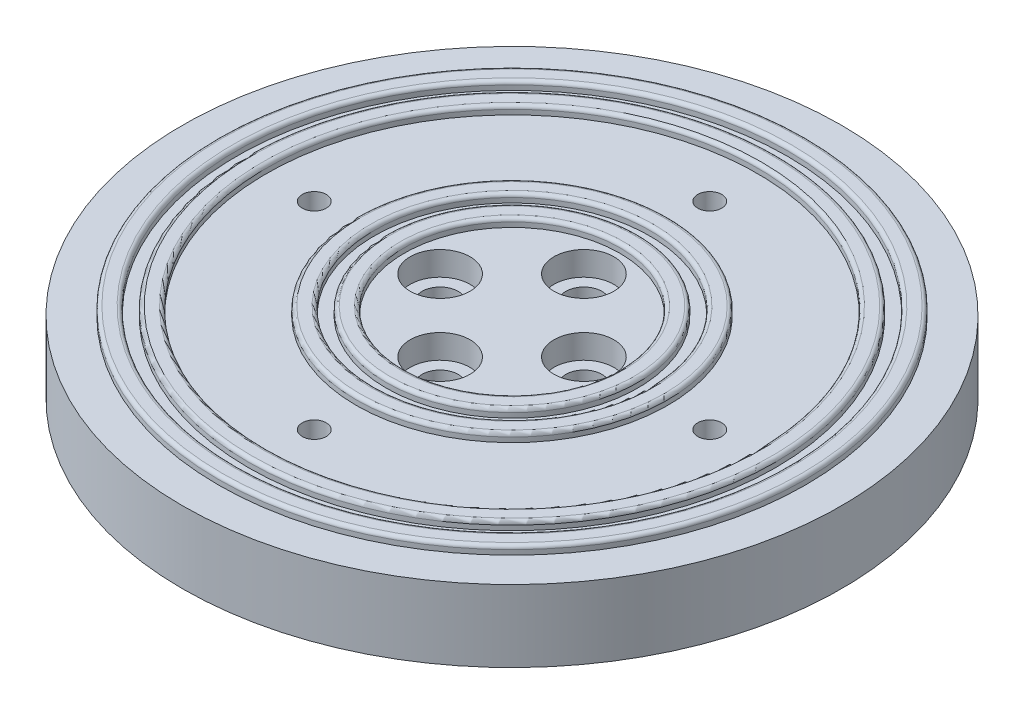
ISO-10303-21;
HEADER;
FILE_DESCRIPTION(('STEP AP214'),'2;1');
FILE_NAME('part.step','',(''),(''),'','','');
FILE_SCHEMA(('AUTOMOTIVE_DESIGN { 1 0 10303 214 1 1 1 1 }'));
ENDSEC;
DATA;
#1=APPLICATION_CONTEXT('core data for automotive mechanical design processes');
#2=APPLICATION_PROTOCOL_DEFINITION('international standard','automotive_design',2000,#1);
#3=PRODUCT_CONTEXT('',#1,'mechanical');
#4=PRODUCT('Part','Part','',(#3));
#5=PRODUCT_RELATED_PRODUCT_CATEGORY('part','',(#4));
#6=PRODUCT_DEFINITION_FORMATION('','',#4);
#7=PRODUCT_DEFINITION_CONTEXT('part definition',#1,'design');
#8=PRODUCT_DEFINITION('design','',#6,#7);
#9=PRODUCT_DEFINITION_SHAPE('','',#8);
#10=(LENGTH_UNIT() NAMED_UNIT(*) SI_UNIT(.MILLI.,.METRE.));
#11=(NAMED_UNIT(*) PLANE_ANGLE_UNIT() SI_UNIT($,.RADIAN.));
#12=(NAMED_UNIT(*) SI_UNIT($,.STERADIAN.) SOLID_ANGLE_UNIT());
#13=UNCERTAINTY_MEASURE_WITH_UNIT(LENGTH_MEASURE(1.E-05),#10,'distance_accuracy_value','');
#14=(GEOMETRIC_REPRESENTATION_CONTEXT(3) GLOBAL_UNCERTAINTY_ASSIGNED_CONTEXT((#13)) GLOBAL_UNIT_ASSIGNED_CONTEXT((#10,
#11,#12)) REPRESENTATION_CONTEXT('',''));
#15=CARTESIAN_POINT('',(0.,0.,0.));
#16=DIRECTION('',(0.,0.,1.));
#17=DIRECTION('',(1.,0.,0.));
#18=AXIS2_PLACEMENT_3D('',#15,#16,#17);
#19=CARTESIAN_POINT('',(0.,0.,0.));
#20=DIRECTION('',(0.,1.,0.));
#21=DIRECTION('',(0.,0.,1.));
#22=AXIS2_PLACEMENT_3D('',#19,#20,#21);
#23=PLANE('',#22);
#24=CARTESIAN_POINT('',(0.,0.,6.));
#25=DIRECTION('',(0.,1.,0.));
#26=DIRECTION('',(0.,0.,1.));
#27=AXIS2_PLACEMENT_3D('',#24,#25,#26);
#28=CIRCLE('',#27,2.5);
#29=CARTESIAN_POINT('',(0.,0.,8.5));
#30=VERTEX_POINT('',#29);
#31=EDGE_CURVE('E217',#30,#30,#28,.T.);
#32=ORIENTED_EDGE('',*,*,#31,.F.);
#33=EDGE_LOOP('',(#32));
#34=FACE_BOUND('',#33,.T.);
#35=CARTESIAN_POINT('',(6.,0.,0.));
#36=DIRECTION('',(0.,1.,0.));
#37=DIRECTION('',(0.,0.,1.));
#38=AXIS2_PLACEMENT_3D('',#35,#36,#37);
#39=CIRCLE('',#38,2.5);
#40=CARTESIAN_POINT('',(6.,0.,2.5));
#41=VERTEX_POINT('',#40);
#42=EDGE_CURVE('E214',#41,#41,#39,.T.);
#43=ORIENTED_EDGE('',*,*,#42,.F.);
#44=EDGE_LOOP('',(#43));
#45=FACE_BOUND('',#44,.T.);
#46=CARTESIAN_POINT('',(-6.,0.,0.));
#47=DIRECTION('',(0.,1.,0.));
#48=DIRECTION('',(0.,0.,1.));
#49=AXIS2_PLACEMENT_3D('',#46,#47,#48);
#50=CIRCLE('',#49,2.5);
#51=CARTESIAN_POINT('',(-6.,0.,2.5));
#52=VERTEX_POINT('',#51);
#53=EDGE_CURVE('E208',#52,#52,#50,.T.);
#54=ORIENTED_EDGE('',*,*,#53,.F.);
#55=EDGE_LOOP('',(#54));
#56=FACE_BOUND('',#55,.T.);
#57=CARTESIAN_POINT('',(0.,0.,-6.));
#58=DIRECTION('',(0.,1.,0.));
#59=DIRECTION('',(0.,0.,1.));
#60=AXIS2_PLACEMENT_3D('',#57,#58,#59);
#61=CIRCLE('',#60,2.5);
#62=CARTESIAN_POINT('',(0.,0.,-3.5));
#63=VERTEX_POINT('',#62);
#64=EDGE_CURVE('E201',#63,#63,#61,.T.);
#65=ORIENTED_EDGE('',*,*,#64,.F.);
#66=EDGE_LOOP('',(#65));
#67=FACE_BOUND('',#66,.T.);
#68=CARTESIAN_POINT('',(0.,0.,0.));
#69=DIRECTION('',(0.,1.,0.));
#70=DIRECTION('',(0.,0.,1.));
#71=AXIS2_PLACEMENT_3D('',#68,#69,#70);
#72=CIRCLE('',#71,9.);
#73=CARTESIAN_POINT('',(0.,0.,9.));
#74=VERTEX_POINT('',#73);
#75=EDGE_CURVE('E131',#74,#74,#72,.F.);
#76=ORIENTED_EDGE('',*,*,#75,.F.);
#77=EDGE_LOOP('',(#76));
#78=FACE_BOUND('',#77,.T.);
#79=ADVANCED_FACE('F75',(#34,#45,#56,#67,#78),#23,.T.);
#80=CARTESIAN_POINT('',(0.,0.,0.));
#81=DIRECTION('',(0.,1.,0.));
#82=DIRECTION('',(0.,0.,1.));
#83=AXIS2_PLACEMENT_3D('',#80,#81,#82);
#84=CIRCLE('',#83,10.5);
#85=CARTESIAN_POINT('',(0.,0.,10.5));
#86=VERTEX_POINT('',#85);
#87=EDGE_CURVE('E230',#86,#86,#84,.T.);
#88=ORIENTED_EDGE('',*,*,#87,.F.);
#89=EDGE_LOOP('',(#88));
#90=FACE_BOUND('',#89,.T.);
#91=CARTESIAN_POINT('',(0.,0.,0.));
#92=DIRECTION('',(0.,1.,0.));
#93=DIRECTION('',(0.,0.,1.));
#94=AXIS2_PLACEMENT_3D('',#91,#92,#93);
#95=CIRCLE('',#94,11.5);
#96=CARTESIAN_POINT('',(0.,0.,11.5));
#97=VERTEX_POINT('',#96);
#98=EDGE_CURVE('E134',#97,#97,#95,.F.);
#99=ORIENTED_EDGE('',*,*,#98,.F.);
#100=EDGE_LOOP('',(#99));
#101=FACE_BOUND('',#100,.T.);
#102=ADVANCED_FACE('F236',(#90,#101),#23,.T.);
#103=CARTESIAN_POINT('',(0.,0.,0.));
#104=DIRECTION('',(0.,1.,0.));
#105=DIRECTION('',(0.,0.,1.));
#106=AXIS2_PLACEMENT_3D('',#103,#104,#105);
#107=CIRCLE('',#106,13.);
#108=CARTESIAN_POINT('',(0.,0.,13.));
#109=VERTEX_POINT('',#108);
#110=EDGE_CURVE('E227',#109,#109,#107,.T.);
#111=ORIENTED_EDGE('',*,*,#110,.F.);
#112=EDGE_LOOP('',(#111));
#113=FACE_BOUND('',#112,.T.);
#114=CARTESIAN_POINT('',(16.5,0.,-1.72828326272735E-13));
#115=DIRECTION('',(0.,1.,0.));
#116=DIRECTION('',(0.,0.,1.));
#117=AXIS2_PLACEMENT_3D('',#114,#115,#116);
#118=CIRCLE('',#117,1.);
#119=CARTESIAN_POINT('',(16.5,0.,0.999999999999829));
#120=VERTEX_POINT('',#119);
#121=EDGE_CURVE('E147',#120,#120,#118,.T.);
#122=ORIENTED_EDGE('',*,*,#121,.F.);
#123=EDGE_LOOP('',(#122));
#124=FACE_BOUND('',#123,.T.);
#125=CARTESIAN_POINT('',(0.,0.,16.5));
#126=DIRECTION('',(0.,1.,0.));
#127=DIRECTION('',(0.,0.,1.));
#128=AXIS2_PLACEMENT_3D('',#125,#126,#127);
#129=CIRCLE('',#128,1.);
#130=CARTESIAN_POINT('',(0.,0.,17.5));
#131=VERTEX_POINT('',#130);
#132=EDGE_CURVE('E168',#131,#131,#129,.T.);
#133=ORIENTED_EDGE('',*,*,#132,.F.);
#134=EDGE_LOOP('',(#133));
#135=FACE_BOUND('',#134,.T.);
#136=CARTESIAN_POINT('',(-16.5,0.,0.));
#137=DIRECTION('',(0.,1.,0.));
#138=DIRECTION('',(0.,0.,1.));
#139=AXIS2_PLACEMENT_3D('',#136,#137,#138);
#140=CIRCLE('',#139,1.);
#141=CARTESIAN_POINT('',(-16.5,0.,1.00000000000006));
#142=VERTEX_POINT('',#141);
#143=EDGE_CURVE('E165',#142,#142,#140,.T.);
#144=ORIENTED_EDGE('',*,*,#143,.F.);
#145=EDGE_LOOP('',(#144));
#146=FACE_BOUND('',#145,.T.);
#147=CARTESIAN_POINT('',(0.,0.,-16.5));
#148=DIRECTION('',(0.,1.,0.));
#149=DIRECTION('',(0.,0.,1.));
#150=AXIS2_PLACEMENT_3D('',#147,#148,#149);
#151=CIRCLE('',#150,1.);
#152=CARTESIAN_POINT('',(0.,0.,-15.5));
#153=VERTEX_POINT('',#152);
#154=EDGE_CURVE('E162',#153,#153,#151,.T.);
#155=ORIENTED_EDGE('',*,*,#154,.F.);
#156=EDGE_LOOP('',(#155));
#157=FACE_BOUND('',#156,.T.);
#158=CARTESIAN_POINT('',(0.,0.,0.));
#159=DIRECTION('',(0.,1.,0.));
#160=DIRECTION('',(0.,0.,1.));
#161=AXIS2_PLACEMENT_3D('',#158,#159,#160);
#162=CIRCLE('',#161,20.5);
#163=CARTESIAN_POINT('',(0.,0.,20.5));
#164=VERTEX_POINT('',#163);
#165=EDGE_CURVE('E137',#164,#164,#162,.F.);
#166=ORIENTED_EDGE('',*,*,#165,.F.);
#167=EDGE_LOOP('',(#166));
#168=FACE_BOUND('',#167,.T.);
#169=ADVANCED_FACE('F239',(#113,#124,#135,#146,#157,#168),#23,.T.);
#170=CARTESIAN_POINT('',(0.,0.,0.));
#171=DIRECTION('',(0.,1.,0.));
#172=DIRECTION('',(0.,0.,1.));
#173=AXIS2_PLACEMENT_3D('',#170,#171,#172);
#174=CIRCLE('',#173,22.);
#175=CARTESIAN_POINT('',(0.,0.,22.));
#176=VERTEX_POINT('',#175);
#177=EDGE_CURVE('E224',#176,#176,#174,.T.);
#178=ORIENTED_EDGE('',*,*,#177,.F.);
#179=EDGE_LOOP('',(#178));
#180=FACE_BOUND('',#179,.T.);
#181=CARTESIAN_POINT('',(0.,0.,0.));
#182=DIRECTION('',(0.,1.,0.));
#183=DIRECTION('',(0.,0.,1.));
#184=AXIS2_PLACEMENT_3D('',#181,#182,#183);
#185=CIRCLE('',#184,23.);
#186=CARTESIAN_POINT('',(0.,0.,23.));
#187=VERTEX_POINT('',#186);
#188=EDGE_CURVE('E140',#187,#187,#185,.F.);
#189=ORIENTED_EDGE('',*,*,#188,.F.);
#190=EDGE_LOOP('',(#189));
#191=FACE_BOUND('',#190,.T.);
#192=ADVANCED_FACE('F273',(#180,#191),#23,.T.);
#193=CARTESIAN_POINT('',(6.,-6.,0.));
#194=DIRECTION('',(0.,1.,0.));
#195=DIRECTION('',(0.,0.,1.));
#196=AXIS2_PLACEMENT_3D('',#193,#194,#195);
#197=CYLINDRICAL_SURFACE('',#196,1.5);
#198=CARTESIAN_POINT('',(6.,-6.,0.));
#199=DIRECTION('',(0.,1.,0.));
#200=DIRECTION('',(0.,0.,1.));
#201=AXIS2_PLACEMENT_3D('',#198,#199,#200);
#202=CIRCLE('',#201,1.5);
#203=CARTESIAN_POINT('',(6.,-6.,1.5));
#204=VERTEX_POINT('',#203);
#205=EDGE_CURVE('E175',#204,#204,#202,.T.);
#206=ORIENTED_EDGE('',*,*,#205,.F.);
#207=EDGE_LOOP('',(#206));
#208=FACE_BOUND('',#207,.T.);
#209=CARTESIAN_POINT('',(6.,-2.,0.));
#210=DIRECTION('',(0.,1.,0.));
#211=DIRECTION('',(0.,0.,1.));
#212=AXIS2_PLACEMENT_3D('',#209,#210,#211);
#213=CIRCLE('',#212,1.5);
#214=CARTESIAN_POINT('',(6.,-2.,1.5));
#215=VERTEX_POINT('',#214);
#216=EDGE_CURVE('E144',#215,#215,#213,.F.);
#217=ORIENTED_EDGE('',*,*,#216,.F.);
#218=EDGE_LOOP('',(#217));
#219=FACE_BOUND('',#218,.T.);
#220=ADVANCED_FACE('F287',(#208,#219),#197,.F.);
#221=CARTESIAN_POINT('',(0.,-6.,6.));
#222=DIRECTION('',(0.,1.,0.));
#223=DIRECTION('',(0.,0.,1.));
#224=AXIS2_PLACEMENT_3D('',#221,#222,#223);
#225=CYLINDRICAL_SURFACE('',#224,1.5);
#226=CARTESIAN_POINT('',(0.,-6.,6.));
#227=DIRECTION('',(0.,1.,0.));
#228=DIRECTION('',(0.,0.,1.));
#229=AXIS2_PLACEMENT_3D('',#226,#227,#228);
#230=CIRCLE('',#229,1.5);
#231=CARTESIAN_POINT('',(0.,-6.,7.5));
#232=VERTEX_POINT('',#231);
#233=EDGE_CURVE('E178',#232,#232,#230,.T.);
#234=ORIENTED_EDGE('',*,*,#233,.F.);
#235=EDGE_LOOP('',(#234));
#236=FACE_BOUND('',#235,.T.);
#237=CARTESIAN_POINT('',(0.,-2.,6.));
#238=DIRECTION('',(0.,1.,0.));
#239=DIRECTION('',(0.,0.,1.));
#240=AXIS2_PLACEMENT_3D('',#237,#238,#239);
#241=CIRCLE('',#240,1.5);
#242=CARTESIAN_POINT('',(0.,-2.,7.5));
#243=VERTEX_POINT('',#242);
#244=EDGE_CURVE('E148',#243,#243,#241,.F.);
#245=ORIENTED_EDGE('',*,*,#244,.F.);
#246=EDGE_LOOP('',(#245));
#247=FACE_BOUND('',#246,.T.);
#248=ADVANCED_FACE('F293',(#236,#247),#225,.F.);
#249=CARTESIAN_POINT('',(-6.,-6.,0.));
#250=DIRECTION('',(0.,1.,0.));
#251=DIRECTION('',(0.,0.,1.));
#252=AXIS2_PLACEMENT_3D('',#249,#250,#251);
#253=CYLINDRICAL_SURFACE('',#252,1.5);
#254=CARTESIAN_POINT('',(-6.,-6.,0.));
#255=DIRECTION('',(0.,1.,0.));
#256=DIRECTION('',(0.,0.,1.));
#257=AXIS2_PLACEMENT_3D('',#254,#255,#256);
#258=CIRCLE('',#257,1.5);
#259=CARTESIAN_POINT('',(-6.,-6.,1.5));
#260=VERTEX_POINT('',#259);
#261=EDGE_CURVE('E181',#260,#260,#258,.T.);
#262=ORIENTED_EDGE('',*,*,#261,.F.);
#263=EDGE_LOOP('',(#262));
#264=FACE_BOUND('',#263,.T.);
#265=CARTESIAN_POINT('',(-6.,-2.,0.));
#266=DIRECTION('',(0.,1.,0.));
#267=DIRECTION('',(0.,0.,1.));
#268=AXIS2_PLACEMENT_3D('',#265,#266,#267);
#269=CIRCLE('',#268,1.5);
#270=CARTESIAN_POINT('',(-6.,-2.,1.5));
#271=VERTEX_POINT('',#270);
#272=EDGE_CURVE('E151',#271,#271,#269,.F.);
#273=ORIENTED_EDGE('',*,*,#272,.F.);
#274=EDGE_LOOP('',(#273));
#275=FACE_BOUND('',#274,.T.);
#276=ADVANCED_FACE('F612',(#264,#275),#253,.F.);
#277=CARTESIAN_POINT('',(0.,-6.,-6.));
#278=DIRECTION('',(0.,1.,0.));
#279=DIRECTION('',(0.,0.,1.));
#280=AXIS2_PLACEMENT_3D('',#277,#278,#279);
#281=CYLINDRICAL_SURFACE('',#280,1.5);
#282=CARTESIAN_POINT('',(0.,-6.,-6.));
#283=DIRECTION('',(0.,1.,0.));
#284=DIRECTION('',(0.,0.,1.));
#285=AXIS2_PLACEMENT_3D('',#282,#283,#284);
#286=CIRCLE('',#285,1.5);
#287=CARTESIAN_POINT('',(0.,-6.,-4.5));
#288=VERTEX_POINT('',#287);
#289=EDGE_CURVE('E143',#288,#288,#286,.T.);
#290=ORIENTED_EDGE('',*,*,#289,.F.);
#291=EDGE_LOOP('',(#290));
#292=FACE_BOUND('',#291,.T.);
#293=CARTESIAN_POINT('',(0.,-2.,-6.));
#294=DIRECTION('',(0.,1.,0.));
#295=DIRECTION('',(0.,0.,1.));
#296=AXIS2_PLACEMENT_3D('',#293,#294,#295);
#297=CIRCLE('',#296,1.5);
#298=CARTESIAN_POINT('',(0.,-2.,-4.5));
#299=VERTEX_POINT('',#298);
#300=EDGE_CURVE('E154',#299,#299,#297,.F.);
#301=ORIENTED_EDGE('',*,*,#300,.F.);
#302=EDGE_LOOP('',(#301));
#303=FACE_BOUND('',#302,.T.);
#304=ADVANCED_FACE('F621',(#292,#303),#281,.F.);
#305=CARTESIAN_POINT('',(0.,-6.,0.));
#306=DIRECTION('',(0.,1.,0.));
#307=DIRECTION('',(0.,0.,1.));
#308=AXIS2_PLACEMENT_3D('',#305,#306,#307);
#309=CYLINDRICAL_SURFACE('',#308,27.5);
#310=CARTESIAN_POINT('',(0.,-6.,0.));
#311=DIRECTION('',(0.,1.,0.));
#312=DIRECTION('',(0.,0.,1.));
#313=AXIS2_PLACEMENT_3D('',#310,#311,#312);
#314=CIRCLE('',#313,27.5);
#315=CARTESIAN_POINT('',(0.,-6.,27.5));
#316=VERTEX_POINT('',#315);
#317=EDGE_CURVE('E184',#316,#316,#314,.T.);
#318=ORIENTED_EDGE('',*,*,#317,.T.);
#319=EDGE_LOOP('',(#318));
#320=FACE_BOUND('',#319,.T.);
#321=CARTESIAN_POINT('',(0.,0.,0.));
#322=DIRECTION('',(0.,1.,0.));
#323=DIRECTION('',(0.,0.,1.));
#324=AXIS2_PLACEMENT_3D('',#321,#322,#323);
#325=CIRCLE('',#324,27.5);
#326=CARTESIAN_POINT('',(0.,0.,27.5));
#327=VERTEX_POINT('',#326);
#328=EDGE_CURVE('E158',#327,#327,#325,.T.);
#329=ORIENTED_EDGE('',*,*,#328,.F.);
#330=EDGE_LOOP('',(#329));
#331=FACE_BOUND('',#330,.T.);
#332=ADVANCED_FACE('F628',(#320,#331),#309,.T.);
#333=CARTESIAN_POINT('',(0.,-6.,-16.5));
#334=DIRECTION('',(0.,1.,0.));
#335=DIRECTION('',(0.,0.,1.));
#336=AXIS2_PLACEMENT_3D('',#333,#334,#335);
#337=CYLINDRICAL_SURFACE('',#336,1.);
#338=CARTESIAN_POINT('',(0.,-6.,-16.5));
#339=DIRECTION('',(0.,1.,0.));
#340=DIRECTION('',(0.,0.,1.));
#341=AXIS2_PLACEMENT_3D('',#338,#339,#340);
#342=CIRCLE('',#341,1.);
#343=CARTESIAN_POINT('',(0.,-6.,-15.5));
#344=VERTEX_POINT('',#343);
#345=EDGE_CURVE('E187',#344,#344,#342,.T.);
#346=ORIENTED_EDGE('',*,*,#345,.F.);
#347=EDGE_LOOP('',(#346));
#348=FACE_BOUND('',#347,.T.);
#349=ORIENTED_EDGE('',*,*,#154,.T.);
#350=EDGE_LOOP('',(#349));
#351=FACE_BOUND('',#350,.T.);
#352=ADVANCED_FACE('F672',(#348,#351),#337,.F.);
#353=CARTESIAN_POINT('',(-16.5,-6.,0.));
#354=DIRECTION('',(0.,1.,0.));
#355=DIRECTION('',(0.,0.,1.));
#356=AXIS2_PLACEMENT_3D('',#353,#354,#355);
#357=CYLINDRICAL_SURFACE('',#356,1.);
#358=CARTESIAN_POINT('',(-16.5,-6.,0.));
#359=DIRECTION('',(0.,1.,0.));
#360=DIRECTION('',(0.,0.,1.));
#361=AXIS2_PLACEMENT_3D('',#358,#359,#360);
#362=CIRCLE('',#361,1.);
#363=CARTESIAN_POINT('',(-16.5,-6.,1.00000000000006));
#364=VERTEX_POINT('',#363);
#365=EDGE_CURVE('E190',#364,#364,#362,.T.);
#366=ORIENTED_EDGE('',*,*,#365,.F.);
#367=EDGE_LOOP('',(#366));
#368=FACE_BOUND('',#367,.T.);
#369=ORIENTED_EDGE('',*,*,#143,.T.);
#370=EDGE_LOOP('',(#369));
#371=FACE_BOUND('',#370,.T.);
#372=ADVANCED_FACE('F663',(#368,#371),#357,.F.);
#373=CARTESIAN_POINT('',(0.,-6.,16.5));
#374=DIRECTION('',(0.,1.,0.));
#375=DIRECTION('',(0.,0.,1.));
#376=AXIS2_PLACEMENT_3D('',#373,#374,#375);
#377=CYLINDRICAL_SURFACE('',#376,1.);
#378=CARTESIAN_POINT('',(0.,-6.,16.5));
#379=DIRECTION('',(0.,1.,0.));
#380=DIRECTION('',(0.,0.,1.));
#381=AXIS2_PLACEMENT_3D('',#378,#379,#380);
#382=CIRCLE('',#381,1.);
#383=CARTESIAN_POINT('',(0.,-6.,17.5));
#384=VERTEX_POINT('',#383);
#385=EDGE_CURVE('E193',#384,#384,#382,.T.);
#386=ORIENTED_EDGE('',*,*,#385,.F.);
#387=EDGE_LOOP('',(#386));
#388=FACE_BOUND('',#387,.T.);
#389=ORIENTED_EDGE('',*,*,#132,.T.);
#390=EDGE_LOOP('',(#389));
#391=FACE_BOUND('',#390,.T.);
#392=ADVANCED_FACE('F654',(#388,#391),#377,.F.);
#393=CARTESIAN_POINT('',(16.5,-6.,-1.72828326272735E-13));
#394=DIRECTION('',(0.,1.,0.));
#395=DIRECTION('',(0.,0.,1.));
#396=AXIS2_PLACEMENT_3D('',#393,#394,#395);
#397=CYLINDRICAL_SURFACE('',#396,1.);
#398=CARTESIAN_POINT('',(16.5,-6.,-1.72828326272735E-13));
#399=DIRECTION('',(0.,1.,0.));
#400=DIRECTION('',(0.,0.,1.));
#401=AXIS2_PLACEMENT_3D('',#398,#399,#400);
#402=CIRCLE('',#401,1.);
#403=CARTESIAN_POINT('',(16.5,-6.,0.999999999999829));
#404=VERTEX_POINT('',#403);
#405=EDGE_CURVE('E161',#404,#404,#402,.T.);
#406=ORIENTED_EDGE('',*,*,#405,.F.);
#407=EDGE_LOOP('',(#406));
#408=FACE_BOUND('',#407,.T.);
#409=ORIENTED_EDGE('',*,*,#121,.T.);
#410=EDGE_LOOP('',(#409));
#411=FACE_BOUND('',#410,.T.);
#412=ADVANCED_FACE('F283',(#408,#411),#397,.F.);
#413=CARTESIAN_POINT('',(0.,-6.,0.));
#414=DIRECTION('',(0.,1.,0.));
#415=DIRECTION('',(0.,0.,1.));
#416=AXIS2_PLACEMENT_3D('',#413,#414,#415);
#417=PLANE('',#416);
#418=ORIENTED_EDGE('',*,*,#405,.T.);
#419=EDGE_LOOP('',(#418));
#420=FACE_BOUND('',#419,.T.);
#421=ORIENTED_EDGE('',*,*,#385,.T.);
#422=EDGE_LOOP('',(#421));
#423=FACE_BOUND('',#422,.T.);
#424=ORIENTED_EDGE('',*,*,#365,.T.);
#425=EDGE_LOOP('',(#424));
#426=FACE_BOUND('',#425,.T.);
#427=ORIENTED_EDGE('',*,*,#345,.T.);
#428=EDGE_LOOP('',(#427));
#429=FACE_BOUND('',#428,.T.);
#430=ORIENTED_EDGE('',*,*,#317,.F.);
#431=EDGE_LOOP('',(#430));
#432=FACE_BOUND('',#431,.T.);
#433=ORIENTED_EDGE('',*,*,#261,.T.);
#434=EDGE_LOOP('',(#433));
#435=FACE_BOUND('',#434,.T.);
#436=ORIENTED_EDGE('',*,*,#233,.T.);
#437=EDGE_LOOP('',(#436));
#438=FACE_BOUND('',#437,.T.);
#439=ORIENTED_EDGE('',*,*,#205,.T.);
#440=EDGE_LOOP('',(#439));
#441=FACE_BOUND('',#440,.T.);
#442=ORIENTED_EDGE('',*,*,#289,.T.);
#443=EDGE_LOOP('',(#442));
#444=FACE_BOUND('',#443,.T.);
#445=ADVANCED_FACE('F271',(#420,#423,#426,#429,#432,#435,#438,#441,#444),#417,.F.);
#446=CARTESIAN_POINT('',(0.,0.,0.));
#447=DIRECTION('',(0.,1.,0.));
#448=DIRECTION('',(0.,0.,1.));
#449=AXIS2_PLACEMENT_3D('',#446,#447,#448);
#450=CIRCLE('',#449,24.5);
#451=CARTESIAN_POINT('',(0.,0.,24.5));
#452=VERTEX_POINT('',#451);
#453=EDGE_CURVE('E202',#452,#452,#450,.T.);
#454=ORIENTED_EDGE('',*,*,#453,.F.);
#455=EDGE_LOOP('',(#454));
#456=FACE_BOUND('',#455,.T.);
#457=ORIENTED_EDGE('',*,*,#328,.T.);
#458=EDGE_LOOP('',(#457));
#459=FACE_BOUND('',#458,.T.);
#460=ADVANCED_FACE('F261',(#456,#459),#23,.T.);
#461=CARTESIAN_POINT('',(0.,-2.,-6.));
#462=DIRECTION('',(0.,1.,0.));
#463=DIRECTION('',(0.,0.,1.));
#464=AXIS2_PLACEMENT_3D('',#461,#462,#463);
#465=PLANE('',#464);
#466=CARTESIAN_POINT('',(0.,-2.,-6.));
#467=DIRECTION('',(0.,1.,0.));
#468=DIRECTION('',(0.,0.,1.));
#469=AXIS2_PLACEMENT_3D('',#466,#467,#468);
#470=CIRCLE('',#469,2.5);
#471=CARTESIAN_POINT('',(0.,-2.,-3.5));
#472=VERTEX_POINT('',#471);
#473=EDGE_CURVE('E198',#472,#472,#470,.T.);
#474=ORIENTED_EDGE('',*,*,#473,.T.);
#475=EDGE_LOOP('',(#474));
#476=FACE_BOUND('',#475,.T.);
#477=ORIENTED_EDGE('',*,*,#300,.T.);
#478=EDGE_LOOP('',(#477));
#479=FACE_BOUND('',#478,.T.);
#480=ADVANCED_FACE('F270',(#476,#479),#465,.T.);
#481=CARTESIAN_POINT('',(0.,-2.,-6.));
#482=DIRECTION('',(0.,1.,0.));
#483=DIRECTION('',(0.,0.,1.));
#484=AXIS2_PLACEMENT_3D('',#481,#482,#483);
#485=CYLINDRICAL_SURFACE('',#484,2.5);
#486=ORIENTED_EDGE('',*,*,#473,.F.);
#487=EDGE_LOOP('',(#486));
#488=FACE_BOUND('',#487,.T.);
#489=ORIENTED_EDGE('',*,*,#64,.T.);
#490=EDGE_LOOP('',(#489));
#491=FACE_BOUND('',#490,.T.);
#492=ADVANCED_FACE('F279',(#488,#491),#485,.F.);
#493=CARTESIAN_POINT('',(-6.,-2.,0.));
#494=DIRECTION('',(0.,1.,0.));
#495=DIRECTION('',(0.,0.,1.));
#496=AXIS2_PLACEMENT_3D('',#493,#494,#495);
#497=PLANE('',#496);
#498=CARTESIAN_POINT('',(-6.,-2.,0.));
#499=DIRECTION('',(0.,1.,0.));
#500=DIRECTION('',(0.,0.,1.));
#501=AXIS2_PLACEMENT_3D('',#498,#499,#500);
#502=CIRCLE('',#501,2.5);
#503=CARTESIAN_POINT('',(-6.,-2.,2.5));
#504=VERTEX_POINT('',#503);
#505=EDGE_CURVE('E205',#504,#504,#502,.T.);
#506=ORIENTED_EDGE('',*,*,#505,.T.);
#507=EDGE_LOOP('',(#506));
#508=FACE_BOUND('',#507,.T.);
#509=ORIENTED_EDGE('',*,*,#272,.T.);
#510=EDGE_LOOP('',(#509));
#511=FACE_BOUND('',#510,.T.);
#512=ADVANCED_FACE('F331',(#508,#511),#497,.T.);
#513=CARTESIAN_POINT('',(-6.,-2.,0.));
#514=DIRECTION('',(0.,1.,0.));
#515=DIRECTION('',(0.,0.,1.));
#516=AXIS2_PLACEMENT_3D('',#513,#514,#515);
#517=CYLINDRICAL_SURFACE('',#516,2.5);
#518=ORIENTED_EDGE('',*,*,#505,.F.);
#519=EDGE_LOOP('',(#518));
#520=FACE_BOUND('',#519,.T.);
#521=ORIENTED_EDGE('',*,*,#53,.T.);
#522=EDGE_LOOP('',(#521));
#523=FACE_BOUND('',#522,.T.);
#524=ADVANCED_FACE('F327',(#520,#523),#517,.F.);
#525=CARTESIAN_POINT('',(6.,-2.,0.));
#526=DIRECTION('',(0.,1.,0.));
#527=DIRECTION('',(0.,0.,1.));
#528=AXIS2_PLACEMENT_3D('',#525,#526,#527);
#529=PLANE('',#528);
#530=CARTESIAN_POINT('',(6.,-2.,0.));
#531=DIRECTION('',(0.,1.,0.));
#532=DIRECTION('',(0.,0.,1.));
#533=AXIS2_PLACEMENT_3D('',#530,#531,#532);
#534=CIRCLE('',#533,2.5);
#535=CARTESIAN_POINT('',(6.,-2.,2.5));
#536=VERTEX_POINT('',#535);
#537=EDGE_CURVE('E211',#536,#536,#534,.T.);
#538=ORIENTED_EDGE('',*,*,#537,.T.);
#539=EDGE_LOOP('',(#538));
#540=FACE_BOUND('',#539,.T.);
#541=ORIENTED_EDGE('',*,*,#216,.T.);
#542=EDGE_LOOP('',(#541));
#543=FACE_BOUND('',#542,.T.);
#544=ADVANCED_FACE('F323',(#540,#543),#529,.T.);
#545=CARTESIAN_POINT('',(6.,-2.,0.));
#546=DIRECTION('',(0.,1.,0.));
#547=DIRECTION('',(0.,0.,1.));
#548=AXIS2_PLACEMENT_3D('',#545,#546,#547);
#549=CYLINDRICAL_SURFACE('',#548,2.5);
#550=ORIENTED_EDGE('',*,*,#537,.F.);
#551=EDGE_LOOP('',(#550));
#552=FACE_BOUND('',#551,.T.);
#553=ORIENTED_EDGE('',*,*,#42,.T.);
#554=EDGE_LOOP('',(#553));
#555=FACE_BOUND('',#554,.T.);
#556=ADVANCED_FACE('F318',(#552,#555),#549,.F.);
#557=CARTESIAN_POINT('',(0.,-2.,6.));
#558=DIRECTION('',(0.,1.,0.));
#559=DIRECTION('',(0.,0.,1.));
#560=AXIS2_PLACEMENT_3D('',#557,#558,#559);
#561=PLANE('',#560);
#562=CARTESIAN_POINT('',(0.,-2.,6.));
#563=DIRECTION('',(0.,1.,0.));
#564=DIRECTION('',(0.,0.,1.));
#565=AXIS2_PLACEMENT_3D('',#562,#563,#564);
#566=CIRCLE('',#565,2.5);
#567=CARTESIAN_POINT('',(0.,-2.,8.5));
#568=VERTEX_POINT('',#567);
#569=EDGE_CURVE('E157',#568,#568,#566,.T.);
#570=ORIENTED_EDGE('',*,*,#569,.T.);
#571=EDGE_LOOP('',(#570));
#572=FACE_BOUND('',#571,.T.);
#573=ORIENTED_EDGE('',*,*,#244,.T.);
#574=EDGE_LOOP('',(#573));
#575=FACE_BOUND('',#574,.T.);
#576=ADVANCED_FACE('F312',(#572,#575),#561,.T.);
#577=CARTESIAN_POINT('',(0.,-2.,6.));
#578=DIRECTION('',(0.,1.,0.));
#579=DIRECTION('',(0.,0.,1.));
#580=AXIS2_PLACEMENT_3D('',#577,#578,#579);
#581=CYLINDRICAL_SURFACE('',#580,2.5);
#582=ORIENTED_EDGE('',*,*,#569,.F.);
#583=EDGE_LOOP('',(#582));
#584=FACE_BOUND('',#583,.T.);
#585=ORIENTED_EDGE('',*,*,#31,.T.);
#586=EDGE_LOOP('',(#585));
#587=FACE_BOUND('',#586,.T.);
#588=ADVANCED_FACE('F303',(#584,#587),#581,.F.);
#589=CARTESIAN_POINT('',(0.,0.7,0.));
#590=DIRECTION('',(0.,-1.,0.));
#591=DIRECTION('',(0.,0.,-1.));
#592=AXIS2_PLACEMENT_3D('',#589,#590,#591);
#593=CYLINDRICAL_SURFACE('',#592,23.);
#594=CARTESIAN_POINT('',(0.,0.4,0.));
#595=DIRECTION('',(0.,1.,0.));
#596=DIRECTION('',(0.,0.,1.));
#597=AXIS2_PLACEMENT_3D('',#594,#595,#596);
#598=CIRCLE('',#597,23.);
#599=CARTESIAN_POINT('',(0.,0.4,23.));
#600=VERTEX_POINT('',#599);
#601=EDGE_CURVE('E95',#600,#600,#598,.T.);
#602=ORIENTED_EDGE('',*,*,#601,.T.);
#603=EDGE_LOOP('',(#602));
#604=FACE_BOUND('',#603,.T.);
#605=ORIENTED_EDGE('',*,*,#188,.T.);
#606=EDGE_LOOP('',(#605));
#607=FACE_BOUND('',#606,.T.);
#608=ADVANCED_FACE('F301',(#604,#607),#593,.F.);
#609=CARTESIAN_POINT('',(0.,0.7,0.));
#610=DIRECTION('',(0.,-1.,0.));
#611=DIRECTION('',(0.,0.,-1.));
#612=AXIS2_PLACEMENT_3D('',#609,#610,#611);
#613=CYLINDRICAL_SURFACE('',#612,24.5);
#614=CARTESIAN_POINT('',(0.,0.4,0.));
#615=DIRECTION('',(0.,1.,0.));
#616=DIRECTION('',(0.,0.,1.));
#617=AXIS2_PLACEMENT_3D('',#614,#615,#616);
#618=CIRCLE('',#617,24.5);
#619=CARTESIAN_POINT('',(0.,0.4,24.5));
#620=VERTEX_POINT('',#619);
#621=EDGE_CURVE('E98',#620,#620,#618,.F.);
#622=ORIENTED_EDGE('',*,*,#621,.T.);
#623=EDGE_LOOP('',(#622));
#624=FACE_BOUND('',#623,.T.);
#625=ORIENTED_EDGE('',*,*,#453,.T.);
#626=EDGE_LOOP('',(#625));
#627=FACE_BOUND('',#626,.T.);
#628=ADVANCED_FACE('F302',(#624,#627),#613,.T.);
#629=CARTESIAN_POINT('',(0.,0.7,0.));
#630=DIRECTION('',(0.,1.,0.));
#631=DIRECTION('',(0.,0.,1.));
#632=AXIS2_PLACEMENT_3D('',#629,#630,#631);
#633=PLANE('',#632);
#634=CARTESIAN_POINT('',(0.,0.7,0.));
#635=DIRECTION('',(0.,1.,0.));
#636=DIRECTION('',(0.,0.,1.));
#637=AXIS2_PLACEMENT_3D('',#634,#635,#636);
#638=CIRCLE('',#637,24.2);
#639=CARTESIAN_POINT('',(0.,0.7,24.2));
#640=VERTEX_POINT('',#639);
#641=EDGE_CURVE('E101',#640,#640,#638,.T.);
#642=ORIENTED_EDGE('',*,*,#641,.T.);
#643=EDGE_LOOP('',(#642));
#644=FACE_BOUND('',#643,.T.);
#645=CARTESIAN_POINT('',(0.,0.7,0.));
#646=DIRECTION('',(0.,1.,0.));
#647=DIRECTION('',(0.,0.,1.));
#648=AXIS2_PLACEMENT_3D('',#645,#646,#647);
#649=CIRCLE('',#648,23.3);
#650=CARTESIAN_POINT('',(0.,0.7,23.3));
#651=VERTEX_POINT('',#650);
#652=EDGE_CURVE('E104',#651,#651,#649,.F.);
#653=ORIENTED_EDGE('',*,*,#652,.T.);
#654=EDGE_LOOP('',(#653));
#655=FACE_BOUND('',#654,.T.);
#656=ADVANCED_FACE('F309',(#644,#655),#633,.T.);
#657=CARTESIAN_POINT('',(0.,0.7,0.));
#658=DIRECTION('',(0.,-1.,0.));
#659=DIRECTION('',(0.,0.,-1.));
#660=AXIS2_PLACEMENT_3D('',#657,#658,#659);
#661=CYLINDRICAL_SURFACE('',#660,20.5);
#662=CARTESIAN_POINT('',(0.,0.4,0.));
#663=DIRECTION('',(0.,1.,0.));
#664=DIRECTION('',(0.,0.,1.));
#665=AXIS2_PLACEMENT_3D('',#662,#663,#664);
#666=CIRCLE('',#665,20.5);
#667=CARTESIAN_POINT('',(0.,0.4,20.5));
#668=VERTEX_POINT('',#667);
#669=EDGE_CURVE('E11',#668,#668,#666,.T.);
#670=ORIENTED_EDGE('',*,*,#669,.T.);
#671=EDGE_LOOP('',(#670));
#672=FACE_BOUND('',#671,.T.);
#673=ORIENTED_EDGE('',*,*,#165,.T.);
#674=EDGE_LOOP('',(#673));
#675=FACE_BOUND('',#674,.T.);
#676=ADVANCED_FACE('F494',(#672,#675),#661,.F.);
#677=CARTESIAN_POINT('',(0.,0.7,0.));
#678=DIRECTION('',(0.,-1.,0.));
#679=DIRECTION('',(0.,0.,-1.));
#680=AXIS2_PLACEMENT_3D('',#677,#678,#679);
#681=CYLINDRICAL_SURFACE('',#680,22.);
#682=CARTESIAN_POINT('',(0.,0.4,0.));
#683=DIRECTION('',(0.,1.,0.));
#684=DIRECTION('',(0.,0.,1.));
#685=AXIS2_PLACEMENT_3D('',#682,#683,#684);
#686=CIRCLE('',#685,22.);
#687=CARTESIAN_POINT('',(0.,0.4,22.));
#688=VERTEX_POINT('',#687);
#689=EDGE_CURVE('E82',#688,#688,#686,.F.);
#690=ORIENTED_EDGE('',*,*,#689,.T.);
#691=EDGE_LOOP('',(#690));
#692=FACE_BOUND('',#691,.T.);
#693=ORIENTED_EDGE('',*,*,#177,.T.);
#694=EDGE_LOOP('',(#693));
#695=FACE_BOUND('',#694,.T.);
#696=ADVANCED_FACE('F256',(#692,#695),#681,.T.);
#697=CARTESIAN_POINT('',(0.,0.7,0.));
#698=DIRECTION('',(0.,1.,0.));
#699=DIRECTION('',(0.,0.,1.));
#700=AXIS2_PLACEMENT_3D('',#697,#698,#699);
#701=PLANE('',#700);
#702=CARTESIAN_POINT('',(0.,0.7,0.));
#703=DIRECTION('',(0.,1.,0.));
#704=DIRECTION('',(0.,0.,1.));
#705=AXIS2_PLACEMENT_3D('',#702,#703,#704);
#706=CIRCLE('',#705,21.7);
#707=CARTESIAN_POINT('',(0.,0.7,21.7));
#708=VERTEX_POINT('',#707);
#709=EDGE_CURVE('E86',#708,#708,#706,.T.);
#710=ORIENTED_EDGE('',*,*,#709,.T.);
#711=EDGE_LOOP('',(#710));
#712=FACE_BOUND('',#711,.T.);
#713=CARTESIAN_POINT('',(0.,0.7,0.));
#714=DIRECTION('',(0.,1.,0.));
#715=DIRECTION('',(0.,0.,1.));
#716=AXIS2_PLACEMENT_3D('',#713,#714,#715);
#717=CIRCLE('',#716,20.8);
#718=CARTESIAN_POINT('',(0.,0.7,20.8));
#719=VERTEX_POINT('',#718);
#720=EDGE_CURVE('E90',#719,#719,#717,.F.);
#721=ORIENTED_EDGE('',*,*,#720,.T.);
#722=EDGE_LOOP('',(#721));
#723=FACE_BOUND('',#722,.T.);
#724=ADVANCED_FACE('F246',(#712,#723),#701,.T.);
#725=CARTESIAN_POINT('',(0.,0.7,0.));
#726=DIRECTION('',(0.,-1.,0.));
#727=DIRECTION('',(0.,0.,-1.));
#728=AXIS2_PLACEMENT_3D('',#725,#726,#727);
#729=CYLINDRICAL_SURFACE('',#728,11.5);
#730=CARTESIAN_POINT('',(0.,0.4,0.));
#731=DIRECTION('',(0.,1.,0.));
#732=DIRECTION('',(0.,0.,1.));
#733=AXIS2_PLACEMENT_3D('',#730,#731,#732);
#734=CIRCLE('',#733,11.5);
#735=CARTESIAN_POINT('',(0.,0.4,11.5));
#736=VERTEX_POINT('',#735);
#737=EDGE_CURVE('E119',#736,#736,#734,.T.);
#738=ORIENTED_EDGE('',*,*,#737,.T.);
#739=EDGE_LOOP('',(#738));
#740=FACE_BOUND('',#739,.T.);
#741=ORIENTED_EDGE('',*,*,#98,.T.);
#742=EDGE_LOOP('',(#741));
#743=FACE_BOUND('',#742,.T.);
#744=ADVANCED_FACE('F243',(#740,#743),#729,.F.);
#745=CARTESIAN_POINT('',(0.,0.7,0.));
#746=DIRECTION('',(0.,-1.,0.));
#747=DIRECTION('',(0.,0.,-1.));
#748=AXIS2_PLACEMENT_3D('',#745,#746,#747);
#749=CYLINDRICAL_SURFACE('',#748,13.);
#750=CARTESIAN_POINT('',(0.,0.4,0.));
#751=DIRECTION('',(0.,1.,0.));
#752=DIRECTION('',(0.,0.,1.));
#753=AXIS2_PLACEMENT_3D('',#750,#751,#752);
#754=CIRCLE('',#753,13.);
#755=CARTESIAN_POINT('',(0.,0.4,13.));
#756=VERTEX_POINT('',#755);
#757=EDGE_CURVE('E122',#756,#756,#754,.F.);
#758=ORIENTED_EDGE('',*,*,#757,.T.);
#759=EDGE_LOOP('',(#758));
#760=FACE_BOUND('',#759,.T.);
#761=ORIENTED_EDGE('',*,*,#110,.T.);
#762=EDGE_LOOP('',(#761));
#763=FACE_BOUND('',#762,.T.);
#764=ADVANCED_FACE('F245',(#760,#763),#749,.T.);
#765=CARTESIAN_POINT('',(0.,0.7,0.));
#766=DIRECTION('',(0.,1.,0.));
#767=DIRECTION('',(0.,0.,1.));
#768=AXIS2_PLACEMENT_3D('',#765,#766,#767);
#769=PLANE('',#768);
#770=CARTESIAN_POINT('',(0.,0.7,0.));
#771=DIRECTION('',(0.,1.,0.));
#772=DIRECTION('',(0.,0.,1.));
#773=AXIS2_PLACEMENT_3D('',#770,#771,#772);
#774=CIRCLE('',#773,12.7);
#775=CARTESIAN_POINT('',(0.,0.7,12.7));
#776=VERTEX_POINT('',#775);
#777=EDGE_CURVE('E125',#776,#776,#774,.T.);
#778=ORIENTED_EDGE('',*,*,#777,.T.);
#779=EDGE_LOOP('',(#778));
#780=FACE_BOUND('',#779,.T.);
#781=CARTESIAN_POINT('',(0.,0.7,0.));
#782=DIRECTION('',(0.,1.,0.));
#783=DIRECTION('',(0.,0.,1.));
#784=AXIS2_PLACEMENT_3D('',#781,#782,#783);
#785=CIRCLE('',#784,11.8);
#786=CARTESIAN_POINT('',(0.,0.7,11.8));
#787=VERTEX_POINT('',#786);
#788=EDGE_CURVE('E128',#787,#787,#785,.F.);
#789=ORIENTED_EDGE('',*,*,#788,.T.);
#790=EDGE_LOOP('',(#789));
#791=FACE_BOUND('',#790,.T.);
#792=ADVANCED_FACE('F253',(#780,#791),#769,.T.);
#793=CARTESIAN_POINT('',(0.,0.7,0.));
#794=DIRECTION('',(0.,-1.,0.));
#795=DIRECTION('',(0.,0.,-1.));
#796=AXIS2_PLACEMENT_3D('',#793,#794,#795);
#797=CYLINDRICAL_SURFACE('',#796,9.);
#798=CARTESIAN_POINT('',(0.,0.4,0.));
#799=DIRECTION('',(0.,1.,0.));
#800=DIRECTION('',(0.,0.,1.));
#801=AXIS2_PLACEMENT_3D('',#798,#799,#800);
#802=CIRCLE('',#801,9.);
#803=CARTESIAN_POINT('',(0.,0.4,9.));
#804=VERTEX_POINT('',#803);
#805=EDGE_CURVE('E107',#804,#804,#802,.T.);
#806=ORIENTED_EDGE('',*,*,#805,.T.);
#807=EDGE_LOOP('',(#806));
#808=FACE_BOUND('',#807,.T.);
#809=ORIENTED_EDGE('',*,*,#75,.T.);
#810=EDGE_LOOP('',(#809));
#811=FACE_BOUND('',#810,.T.);
#812=ADVANCED_FACE('F347',(#808,#811),#797,.F.);
#813=CARTESIAN_POINT('',(0.,0.7,0.));
#814=DIRECTION('',(0.,-1.,0.));
#815=DIRECTION('',(0.,0.,-1.));
#816=AXIS2_PLACEMENT_3D('',#813,#814,#815);
#817=CYLINDRICAL_SURFACE('',#816,10.5);
#818=CARTESIAN_POINT('',(0.,0.4,0.));
#819=DIRECTION('',(0.,1.,0.));
#820=DIRECTION('',(0.,0.,1.));
#821=AXIS2_PLACEMENT_3D('',#818,#819,#820);
#822=CIRCLE('',#821,10.5);
#823=CARTESIAN_POINT('',(0.,0.4,10.5));
#824=VERTEX_POINT('',#823);
#825=EDGE_CURVE('E110',#824,#824,#822,.F.);
#826=ORIENTED_EDGE('',*,*,#825,.T.);
#827=EDGE_LOOP('',(#826));
#828=FACE_BOUND('',#827,.T.);
#829=ORIENTED_EDGE('',*,*,#87,.T.);
#830=EDGE_LOOP('',(#829));
#831=FACE_BOUND('',#830,.T.);
#832=ADVANCED_FACE('F234',(#828,#831),#817,.T.);
#833=CARTESIAN_POINT('',(0.,0.7,0.));
#834=DIRECTION('',(0.,1.,0.));
#835=DIRECTION('',(0.,0.,1.));
#836=AXIS2_PLACEMENT_3D('',#833,#834,#835);
#837=PLANE('',#836);
#838=CARTESIAN_POINT('',(0.,0.7,0.));
#839=DIRECTION('',(0.,1.,0.));
#840=DIRECTION('',(0.,0.,1.));
#841=AXIS2_PLACEMENT_3D('',#838,#839,#840);
#842=CIRCLE('',#841,10.2);
#843=CARTESIAN_POINT('',(0.,0.7,10.2));
#844=VERTEX_POINT('',#843);
#845=EDGE_CURVE('E113',#844,#844,#842,.T.);
#846=ORIENTED_EDGE('',*,*,#845,.T.);
#847=EDGE_LOOP('',(#846));
#848=FACE_BOUND('',#847,.T.);
#849=CARTESIAN_POINT('',(0.,0.7,0.));
#850=DIRECTION('',(0.,1.,0.));
#851=DIRECTION('',(0.,0.,1.));
#852=AXIS2_PLACEMENT_3D('',#849,#850,#851);
#853=CIRCLE('',#852,9.3);
#854=CARTESIAN_POINT('',(0.,0.7,9.3));
#855=VERTEX_POINT('',#854);
#856=EDGE_CURVE('E116',#855,#855,#853,.F.);
#857=ORIENTED_EDGE('',*,*,#856,.T.);
#858=EDGE_LOOP('',(#857));
#859=FACE_BOUND('',#858,.T.);
#860=ADVANCED_FACE('F355',(#848,#859),#837,.T.);
#861=CARTESIAN_POINT('',(0.,0.4,0.));
#862=DIRECTION('',(0.,1.,0.));
#863=DIRECTION('',(0.,0.,1.));
#864=AXIS2_PLACEMENT_3D('',#861,#862,#863);
#865=TOROIDAL_SURFACE('',#864,12.7,0.3);
#866=ORIENTED_EDGE('',*,*,#757,.F.);
#867=EDGE_LOOP('',(#866));
#868=FACE_BOUND('',#867,.T.);
#869=ORIENTED_EDGE('',*,*,#777,.F.);
#870=EDGE_LOOP('',(#869));
#871=FACE_BOUND('',#870,.T.);
#872=ADVANCED_FACE('F362',(#868,#871),#865,.T.);
#873=CARTESIAN_POINT('',(0.,0.4,0.));
#874=DIRECTION('',(0.,1.,0.));
#875=DIRECTION('',(0.,0.,1.));
#876=AXIS2_PLACEMENT_3D('',#873,#874,#875);
#877=TOROIDAL_SURFACE('',#876,11.8,0.3);
#878=ORIENTED_EDGE('',*,*,#788,.F.);
#879=EDGE_LOOP('',(#878));
#880=FACE_BOUND('',#879,.T.);
#881=ORIENTED_EDGE('',*,*,#737,.F.);
#882=EDGE_LOOP('',(#881));
#883=FACE_BOUND('',#882,.T.);
#884=ADVANCED_FACE('F367',(#880,#883),#877,.T.);
#885=CARTESIAN_POINT('',(0.,0.4,0.));
#886=DIRECTION('',(0.,1.,0.));
#887=DIRECTION('',(0.,0.,1.));
#888=AXIS2_PLACEMENT_3D('',#885,#886,#887);
#889=TOROIDAL_SURFACE('',#888,10.2,0.3);
#890=ORIENTED_EDGE('',*,*,#825,.F.);
#891=EDGE_LOOP('',(#890));
#892=FACE_BOUND('',#891,.T.);
#893=ORIENTED_EDGE('',*,*,#845,.F.);
#894=EDGE_LOOP('',(#893));
#895=FACE_BOUND('',#894,.T.);
#896=ADVANCED_FACE('F378',(#892,#895),#889,.T.);
#897=CARTESIAN_POINT('',(0.,0.4,0.));
#898=DIRECTION('',(0.,1.,0.));
#899=DIRECTION('',(0.,0.,1.));
#900=AXIS2_PLACEMENT_3D('',#897,#898,#899);
#901=TOROIDAL_SURFACE('',#900,9.3,0.3);
#902=ORIENTED_EDGE('',*,*,#856,.F.);
#903=EDGE_LOOP('',(#902));
#904=FACE_BOUND('',#903,.T.);
#905=ORIENTED_EDGE('',*,*,#805,.F.);
#906=EDGE_LOOP('',(#905));
#907=FACE_BOUND('',#906,.T.);
#908=ADVANCED_FACE('F374',(#904,#907),#901,.T.);
#909=CARTESIAN_POINT('',(0.,0.4,0.));
#910=DIRECTION('',(0.,1.,0.));
#911=DIRECTION('',(0.,0.,1.));
#912=AXIS2_PLACEMENT_3D('',#909,#910,#911);
#913=TOROIDAL_SURFACE('',#912,24.2,0.3);
#914=ORIENTED_EDGE('',*,*,#621,.F.);
#915=EDGE_LOOP('',(#914));
#916=FACE_BOUND('',#915,.T.);
#917=ORIENTED_EDGE('',*,*,#641,.F.);
#918=EDGE_LOOP('',(#917));
#919=FACE_BOUND('',#918,.T.);
#920=ADVANCED_FACE('F377',(#916,#919),#913,.T.);
#921=CARTESIAN_POINT('',(0.,0.4,0.));
#922=DIRECTION('',(0.,1.,0.));
#923=DIRECTION('',(0.,0.,1.));
#924=AXIS2_PLACEMENT_3D('',#921,#922,#923);
#925=TOROIDAL_SURFACE('',#924,23.3,0.3);
#926=ORIENTED_EDGE('',*,*,#652,.F.);
#927=EDGE_LOOP('',(#926));
#928=FACE_BOUND('',#927,.T.);
#929=ORIENTED_EDGE('',*,*,#601,.F.);
#930=EDGE_LOOP('',(#929));
#931=FACE_BOUND('',#930,.T.);
#932=ADVANCED_FACE('F385',(#928,#931),#925,.T.);
#933=CARTESIAN_POINT('',(0.,0.4,0.));
#934=DIRECTION('',(0.,1.,0.));
#935=DIRECTION('',(0.,0.,1.));
#936=AXIS2_PLACEMENT_3D('',#933,#934,#935);
#937=TOROIDAL_SURFACE('',#936,21.7,0.3);
#938=ORIENTED_EDGE('',*,*,#689,.F.);
#939=EDGE_LOOP('',(#938));
#940=FACE_BOUND('',#939,.T.);
#941=ORIENTED_EDGE('',*,*,#709,.F.);
#942=EDGE_LOOP('',(#941));
#943=FACE_BOUND('',#942,.T.);
#944=ADVANCED_FACE('F393',(#940,#943),#937,.T.);
#945=CARTESIAN_POINT('',(0.,0.4,0.));
#946=DIRECTION('',(0.,1.,0.));
#947=DIRECTION('',(0.,0.,1.));
#948=AXIS2_PLACEMENT_3D('',#945,#946,#947);
#949=TOROIDAL_SURFACE('',#948,20.8,0.3);
#950=ORIENTED_EDGE('',*,*,#720,.F.);
#951=EDGE_LOOP('',(#950));
#952=FACE_BOUND('',#951,.T.);
#953=ORIENTED_EDGE('',*,*,#669,.F.);
#954=EDGE_LOOP('',(#953));
#955=FACE_BOUND('',#954,.T.);
#956=ADVANCED_FACE('F77',(#952,#955),#949,.T.);
#957=CLOSED_SHELL('',(#79,#102,#169,#192,#220,#248,#276,#304,#332,#352,#372,#392,#412,#445,#460,
#480,#492,#512,#524,#544,#556,#576,#588,#608,#628,#656,#676,#696,#724,#744,#764,#792,#812,#832,
#860,#872,#884,#896,#908,#920,#932,#944,#956));
#958=MANIFOLD_SOLID_BREP('B2',#957);
#959=ADVANCED_BREP_SHAPE_REPRESENTATION('',(#18,#958),#14);
#960=SHAPE_DEFINITION_REPRESENTATION(#9,#959);
ENDSEC;
END-ISO-10303-21;
